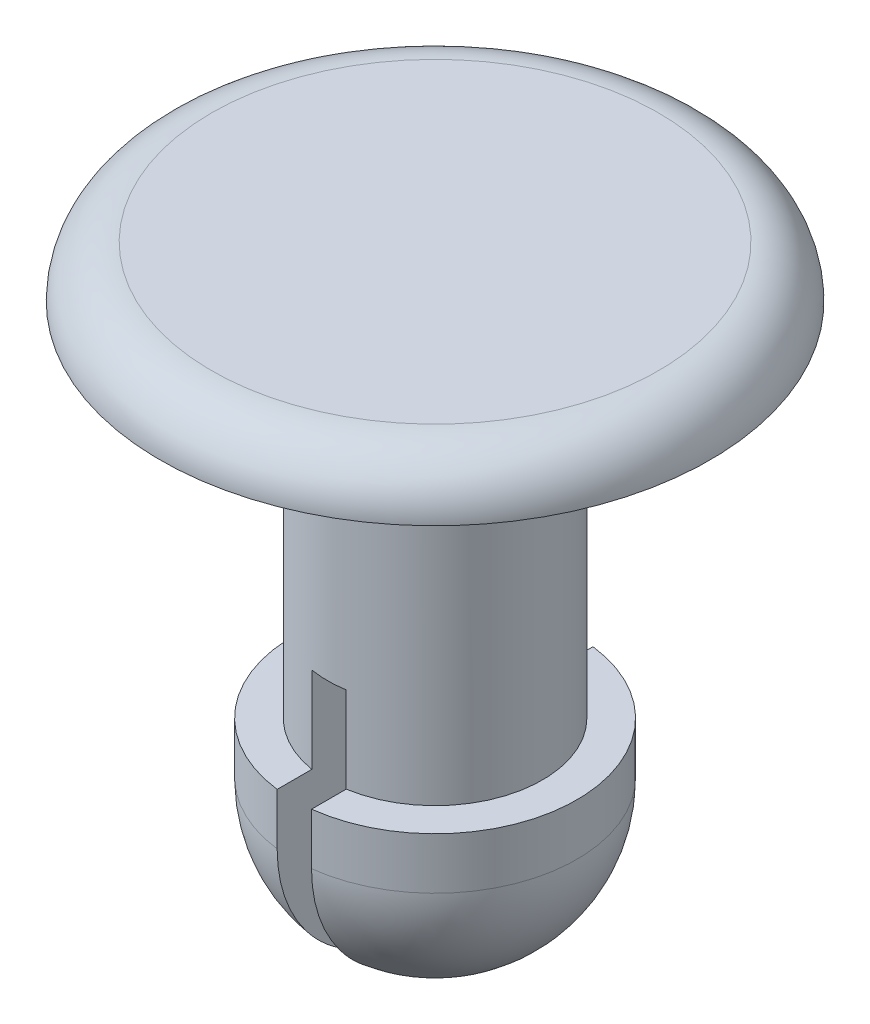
ISO-10303-21;
HEADER;
FILE_DESCRIPTION(('STEP AP214'),'2;1');
FILE_NAME('part.step','',(''),(''),'','','');
FILE_SCHEMA(('AUTOMOTIVE_DESIGN { 1 0 10303 214 1 1 1 1 }'));
ENDSEC;
DATA;
#1=APPLICATION_CONTEXT('core data for automotive mechanical design processes');
#2=APPLICATION_PROTOCOL_DEFINITION('international standard','automotive_design',2000,#1);
#3=PRODUCT_CONTEXT('',#1,'mechanical');
#4=PRODUCT('Part','Part','',(#3));
#5=PRODUCT_RELATED_PRODUCT_CATEGORY('part','',(#4));
#6=PRODUCT_DEFINITION_FORMATION('','',#4);
#7=PRODUCT_DEFINITION_CONTEXT('part definition',#1,'design');
#8=PRODUCT_DEFINITION('design','',#6,#7);
#9=PRODUCT_DEFINITION_SHAPE('','',#8);
#10=(LENGTH_UNIT() NAMED_UNIT(*) SI_UNIT(.MILLI.,.METRE.));
#11=(NAMED_UNIT(*) PLANE_ANGLE_UNIT() SI_UNIT($,.RADIAN.));
#12=(NAMED_UNIT(*) SI_UNIT($,.STERADIAN.) SOLID_ANGLE_UNIT());
#13=UNCERTAINTY_MEASURE_WITH_UNIT(LENGTH_MEASURE(1.E-05),#10,'distance_accuracy_value','');
#14=(GEOMETRIC_REPRESENTATION_CONTEXT(3) GLOBAL_UNCERTAINTY_ASSIGNED_CONTEXT((#13)) GLOBAL_UNIT_ASSIGNED_CONTEXT((#10,
#11,#12)) REPRESENTATION_CONTEXT('',''));
#15=CARTESIAN_POINT('',(0.,0.,0.));
#16=DIRECTION('',(0.,0.,1.));
#17=DIRECTION('',(1.,0.,0.));
#18=AXIS2_PLACEMENT_3D('',#15,#16,#17);
#19=CARTESIAN_POINT('',(1.5875,-5.334,0.));
#20=DIRECTION('',(0.,1.,0.));
#21=DIRECTION('',(-1.,0.,0.));
#22=AXIS2_PLACEMENT_3D('',#19,#20,#21);
#23=PLANE('',#22);
#24=DIRECTION('',(0.,0.,1.));
#25=VECTOR('',#24,1.);
#26=CARTESIAN_POINT('',(-0.253999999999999,-5.334,0.));
#27=LINE('',#26,#25);
#28=CARTESIAN_POINT('',(-0.253999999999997,-5.334,-2.08004909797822));
#29=VERTEX_POINT('',#28);
#30=CARTESIAN_POINT('',(-0.253999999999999,-5.334,-1.56704826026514));
#31=VERTEX_POINT('',#30);
#32=EDGE_CURVE('E51',#29,#31,#27,.T.);
#33=ORIENTED_EDGE('',*,*,#32,.F.);
#34=CARTESIAN_POINT('',(0.,-5.334,0.));
#35=DIRECTION('',(0.,1.,0.));
#36=DIRECTION('',(-1.,0.,0.));
#37=AXIS2_PLACEMENT_3D('',#34,#35,#36);
#38=CIRCLE('',#37,2.0955);
#39=CARTESIAN_POINT('',(-0.253999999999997,-5.334,2.08004909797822));
#40=VERTEX_POINT('',#39);
#41=EDGE_CURVE('E131',#29,#40,#38,.T.);
#42=ORIENTED_EDGE('',*,*,#41,.T.);
#43=CARTESIAN_POINT('',(-0.253999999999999,-5.334,1.56704826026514));
#44=VERTEX_POINT('',#43);
#45=EDGE_CURVE('E121',#44,#40,#27,.T.);
#46=ORIENTED_EDGE('',*,*,#45,.F.);
#47=CARTESIAN_POINT('',(0.,-5.334,0.));
#48=DIRECTION('',(0.,1.,0.));
#49=DIRECTION('',(-1.,0.,0.));
#50=AXIS2_PLACEMENT_3D('',#47,#48,#49);
#51=CIRCLE('',#50,1.5875);
#52=EDGE_CURVE('E135',#31,#44,#51,.T.);
#53=ORIENTED_EDGE('',*,*,#52,.F.);
#54=EDGE_LOOP('',(#33,#42,#46,#53));
#55=FACE_BOUND('',#54,.T.);
#56=ADVANCED_FACE('F28',(#55),#23,.T.);
#57=CARTESIAN_POINT('',(0.,0.,0.));
#58=DIRECTION('',(0.,1.,0.));
#59=DIRECTION('',(-1.,0.,0.));
#60=AXIS2_PLACEMENT_3D('',#57,#58,#59);
#61=CYLINDRICAL_SURFACE('',#60,2.0955);
#62=DIRECTION('',(0.,1.,0.));
#63=VECTOR('',#62,1.);
#64=CARTESIAN_POINT('',(-0.253999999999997,0.,2.08004909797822));
#65=LINE('',#64,#63);
#66=CARTESIAN_POINT('',(-0.253999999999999,-6.096,2.08004909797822));
#67=VERTEX_POINT('',#66);
#68=EDGE_CURVE('E114',#40,#67,#65,.F.);
#69=ORIENTED_EDGE('',*,*,#68,.F.);
#70=ORIENTED_EDGE('',*,*,#41,.F.);
#71=DIRECTION('',(0.,1.,0.));
#72=VECTOR('',#71,1.);
#73=CARTESIAN_POINT('',(-0.253999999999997,0.,-2.08004909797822));
#74=LINE('',#73,#72);
#75=CARTESIAN_POINT('',(-0.253999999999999,-6.096,-2.08004909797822));
#76=VERTEX_POINT('',#75);
#77=EDGE_CURVE('E112',#76,#29,#74,.T.);
#78=ORIENTED_EDGE('',*,*,#77,.F.);
#79=CARTESIAN_POINT('',(0.,-6.096,0.));
#80=DIRECTION('',(0.,1.,0.));
#81=DIRECTION('',(-1.,0.,0.));
#82=AXIS2_PLACEMENT_3D('',#79,#80,#81);
#83=CIRCLE('',#82,2.0955);
#84=EDGE_CURVE('E127',#76,#67,#83,.T.);
#85=ORIENTED_EDGE('',*,*,#84,.T.);
#86=EDGE_LOOP('',(#69,#70,#78,#85));
#87=FACE_BOUND('',#86,.T.);
#88=ADVANCED_FACE('F183',(#87),#61,.T.);
#89=CARTESIAN_POINT('',(0.,-6.096,0.));
#90=DIRECTION('',(0.,1.,0.));
#91=DIRECTION('',(1.,0.,0.));
#92=AXIS2_PLACEMENT_3D('',#89,#90,#91);
#93=SPHERICAL_SURFACE('',#92,2.0955);
#94=CARTESIAN_POINT('',(-0.253999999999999,-6.096,0.));
#95=DIRECTION('',(-1.,0.,0.));
#96=DIRECTION('',(0.,-1.,0.));
#97=AXIS2_PLACEMENT_3D('',#94,#95,#96);
#98=CIRCLE('',#97,2.08004909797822);
#99=EDGE_CURVE('E148',#67,#76,#98,.F.);
#100=ORIENTED_EDGE('',*,*,#99,.F.);
#101=ORIENTED_EDGE('',*,*,#84,.F.);
#102=EDGE_LOOP('',(#100,#101));
#103=FACE_BOUND('',#102,.T.);
#104=ADVANCED_FACE('F174',(#103),#93,.T.);
#105=CARTESIAN_POINT('',(0.,0.762,0.));
#106=DIRECTION('',(0.,1.,0.));
#107=DIRECTION('',(-1.,0.,0.));
#108=AXIS2_PLACEMENT_3D('',#105,#106,#107);
#109=PLANE('',#108);
#110=CARTESIAN_POINT('',(0.,0.762,0.));
#111=DIRECTION('',(0.,1.,0.));
#112=DIRECTION('',(-1.,0.,0.));
#113=AXIS2_PLACEMENT_3D('',#110,#111,#112);
#114=CIRCLE('',#113,3.302);
#115=CARTESIAN_POINT('',(-3.302,0.762,0.));
#116=VERTEX_POINT('',#115);
#117=EDGE_CURVE('E144',#116,#116,#114,.T.);
#118=ORIENTED_EDGE('',*,*,#117,.T.);
#119=EDGE_LOOP('',(#118));
#120=FACE_BOUND('',#119,.T.);
#121=ADVANCED_FACE('F30',(#120),#109,.T.);
#122=CARTESIAN_POINT('',(4.064,0.,0.));
#123=DIRECTION('',(0.,-1.,0.));
#124=DIRECTION('',(1.,0.,0.));
#125=AXIS2_PLACEMENT_3D('',#122,#123,#124);
#126=PLANE('',#125);
#127=CARTESIAN_POINT('',(0.,0.,0.));
#128=DIRECTION('',(0.,1.,0.));
#129=DIRECTION('',(-1.,0.,0.));
#130=AXIS2_PLACEMENT_3D('',#127,#128,#129);
#131=CIRCLE('',#130,1.58749999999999);
#132=CARTESIAN_POINT('',(-1.58749999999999,0.,0.));
#133=VERTEX_POINT('',#132);
#134=EDGE_CURVE('E138',#133,#133,#131,.T.);
#135=ORIENTED_EDGE('',*,*,#134,.T.);
#136=EDGE_LOOP('',(#135));
#137=FACE_BOUND('',#136,.T.);
#138=CARTESIAN_POINT('',(0.,0.,0.));
#139=DIRECTION('',(0.,1.,0.));
#140=DIRECTION('',(-1.,0.,0.));
#141=AXIS2_PLACEMENT_3D('',#138,#139,#140);
#142=CIRCLE('',#141,4.064);
#143=CARTESIAN_POINT('',(-4.064,0.,0.));
#144=VERTEX_POINT('',#143);
#145=EDGE_CURVE('E141',#144,#144,#142,.T.);
#146=ORIENTED_EDGE('',*,*,#145,.F.);
#147=EDGE_LOOP('',(#146));
#148=FACE_BOUND('',#147,.T.);
#149=ADVANCED_FACE('F198',(#137,#148),#126,.T.);
#150=CARTESIAN_POINT('',(0.,0.,0.));
#151=DIRECTION('',(0.,1.,0.));
#152=DIRECTION('',(-1.,0.,0.));
#153=AXIS2_PLACEMENT_3D('',#150,#151,#152);
#154=CYLINDRICAL_SURFACE('',#153,1.5875);
#155=DIRECTION('',(0.,1.,0.));
#156=VECTOR('',#155,1.);
#157=CARTESIAN_POINT('',(-0.253999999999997,0.,-1.56704826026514));
#158=LINE('',#157,#156);
#159=CARTESIAN_POINT('',(-0.253999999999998,-4.064,-1.56704826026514));
#160=VERTEX_POINT('',#159);
#161=EDGE_CURVE('E123',#31,#160,#158,.T.);
#162=ORIENTED_EDGE('',*,*,#161,.F.);
#163=ORIENTED_EDGE('',*,*,#52,.T.);
#164=DIRECTION('',(0.,1.,0.));
#165=VECTOR('',#164,1.);
#166=CARTESIAN_POINT('',(-0.253999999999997,0.,1.56704826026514));
#167=LINE('',#166,#165);
#168=CARTESIAN_POINT('',(-0.253999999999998,-4.064,1.56704826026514));
#169=VERTEX_POINT('',#168);
#170=EDGE_CURVE('E125',#169,#44,#167,.F.);
#171=ORIENTED_EDGE('',*,*,#170,.F.);
#172=CARTESIAN_POINT('',(0.,-4.064,0.));
#173=DIRECTION('',(0.,-1.,0.));
#174=DIRECTION('',(0.,0.,-1.));
#175=AXIS2_PLACEMENT_3D('',#172,#173,#174);
#176=CIRCLE('',#175,1.5875);
#177=CARTESIAN_POINT('',(0.254,-4.064,1.56704826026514));
#178=VERTEX_POINT('',#177);
#179=EDGE_CURVE('E32',#169,#178,#176,.F.);
#180=ORIENTED_EDGE('',*,*,#179,.T.);
#181=DIRECTION('',(0.,1.,0.));
#182=VECTOR('',#181,1.);
#183=CARTESIAN_POINT('',(0.254,0.,1.56704826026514));
#184=LINE('',#183,#182);
#185=CARTESIAN_POINT('',(0.254,-5.334,1.56704826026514));
#186=VERTEX_POINT('',#185);
#187=EDGE_CURVE('E105',#186,#178,#184,.T.);
#188=ORIENTED_EDGE('',*,*,#187,.F.);
#189=CARTESIAN_POINT('',(0.254,-5.334,-1.56704826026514));
#190=VERTEX_POINT('',#189);
#191=EDGE_CURVE('E111',#186,#190,#51,.T.);
#192=ORIENTED_EDGE('',*,*,#191,.T.);
#193=DIRECTION('',(0.,1.,0.));
#194=VECTOR('',#193,1.);
#195=CARTESIAN_POINT('',(0.254,0.,-1.56704826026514));
#196=LINE('',#195,#194);
#197=CARTESIAN_POINT('',(0.254,-4.064,-1.56704826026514));
#198=VERTEX_POINT('',#197);
#199=EDGE_CURVE('E102',#198,#190,#196,.F.);
#200=ORIENTED_EDGE('',*,*,#199,.F.);
#201=EDGE_CURVE('E11',#198,#160,#176,.F.);
#202=ORIENTED_EDGE('',*,*,#201,.T.);
#203=EDGE_LOOP('',(#162,#163,#171,#180,#188,#192,#200,#202));
#204=FACE_BOUND('',#203,.T.);
#205=ORIENTED_EDGE('',*,*,#134,.F.);
#206=EDGE_LOOP('',(#205));
#207=FACE_BOUND('',#206,.T.);
#208=ADVANCED_FACE('F108',(#204,#207),#154,.T.);
#209=DIRECTION('',(0.,0.,-1.));
#210=VECTOR('',#209,1.);
#211=CARTESIAN_POINT('',(0.254,-5.334,0.));
#212=LINE('',#211,#210);
#213=CARTESIAN_POINT('',(0.253999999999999,-5.334,2.08004909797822));
#214=VERTEX_POINT('',#213);
#215=EDGE_CURVE('E116',#214,#186,#212,.T.);
#216=ORIENTED_EDGE('',*,*,#215,.F.);
#217=CARTESIAN_POINT('',(0.253999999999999,-5.334,-2.08004909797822));
#218=VERTEX_POINT('',#217);
#219=EDGE_CURVE('E134',#214,#218,#38,.T.);
#220=ORIENTED_EDGE('',*,*,#219,.T.);
#221=EDGE_CURVE('E158',#190,#218,#212,.T.);
#222=ORIENTED_EDGE('',*,*,#221,.F.);
#223=ORIENTED_EDGE('',*,*,#191,.F.);
#224=EDGE_LOOP('',(#216,#220,#222,#223));
#225=FACE_BOUND('',#224,.T.);
#226=ADVANCED_FACE('F164',(#225),#23,.T.);
#227=DIRECTION('',(0.,1.,0.));
#228=VECTOR('',#227,1.);
#229=CARTESIAN_POINT('',(0.254,0.,-2.08004909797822));
#230=LINE('',#229,#228);
#231=CARTESIAN_POINT('',(0.254,-6.096,-2.08004909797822));
#232=VERTEX_POINT('',#231);
#233=EDGE_CURVE('E43',#218,#232,#230,.F.);
#234=ORIENTED_EDGE('',*,*,#233,.F.);
#235=ORIENTED_EDGE('',*,*,#219,.F.);
#236=DIRECTION('',(0.,1.,0.));
#237=VECTOR('',#236,1.);
#238=CARTESIAN_POINT('',(0.254,0.,2.08004909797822));
#239=LINE('',#238,#237);
#240=CARTESIAN_POINT('',(0.254,-6.096,2.08004909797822));
#241=VERTEX_POINT('',#240);
#242=EDGE_CURVE('E154',#241,#214,#239,.T.);
#243=ORIENTED_EDGE('',*,*,#242,.F.);
#244=EDGE_CURVE('E130',#241,#232,#83,.T.);
#245=ORIENTED_EDGE('',*,*,#244,.T.);
#246=EDGE_LOOP('',(#234,#235,#243,#245));
#247=FACE_BOUND('',#246,.T.);
#248=ADVANCED_FACE('F166',(#247),#61,.T.);
#249=CARTESIAN_POINT('',(0.254,-6.096,0.));
#250=DIRECTION('',(1.,0.,0.));
#251=DIRECTION('',(0.,0.,-1.));
#252=AXIS2_PLACEMENT_3D('',#249,#250,#251);
#253=CIRCLE('',#252,2.08004909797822);
#254=EDGE_CURVE('E147',#232,#241,#253,.F.);
#255=ORIENTED_EDGE('',*,*,#254,.F.);
#256=ORIENTED_EDGE('',*,*,#244,.F.);
#257=EDGE_LOOP('',(#255,#256));
#258=FACE_BOUND('',#257,.T.);
#259=ADVANCED_FACE('F170',(#258),#93,.T.);
#260=CARTESIAN_POINT('',(0.,0.,0.));
#261=DIRECTION('',(0.,1.,0.));
#262=DIRECTION('',(-1.,0.,0.));
#263=AXIS2_PLACEMENT_3D('',#260,#261,#262);
#264=TOROIDAL_SURFACE('',#263,3.302,0.762);
#265=ORIENTED_EDGE('',*,*,#145,.T.);
#266=EDGE_LOOP('',(#265));
#267=FACE_BOUND('',#266,.T.);
#268=ORIENTED_EDGE('',*,*,#117,.F.);
#269=EDGE_LOOP('',(#268));
#270=FACE_BOUND('',#269,.T.);
#271=ADVANCED_FACE('F172',(#267,#270),#264,.T.);
#272=CARTESIAN_POINT('',(-0.253999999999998,-4.064,-4.064));
#273=DIRECTION('',(-1.,0.,0.));
#274=DIRECTION('',(0.,-1.,0.));
#275=AXIS2_PLACEMENT_3D('',#272,#273,#274);
#276=PLANE('',#275);
#277=ORIENTED_EDGE('',*,*,#170,.T.);
#278=ORIENTED_EDGE('',*,*,#45,.T.);
#279=ORIENTED_EDGE('',*,*,#68,.T.);
#280=ORIENTED_EDGE('',*,*,#99,.T.);
#281=ORIENTED_EDGE('',*,*,#77,.T.);
#282=ORIENTED_EDGE('',*,*,#32,.T.);
#283=ORIENTED_EDGE('',*,*,#161,.T.);
#284=DIRECTION('',(0.,0.,1.));
#285=VECTOR('',#284,1.);
#286=CARTESIAN_POINT('',(-0.253999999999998,-4.064,-4.064));
#287=LINE('',#286,#285);
#288=EDGE_CURVE('E98',#160,#169,#287,.T.);
#289=ORIENTED_EDGE('',*,*,#288,.T.);
#290=EDGE_LOOP('',(#277,#278,#279,#280,#281,#282,#283,#289));
#291=FACE_BOUND('',#290,.T.);
#292=ADVANCED_FACE('F152',(#291),#276,.F.);
#293=CARTESIAN_POINT('',(-0.253999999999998,-4.064,-4.064));
#294=DIRECTION('',(0.,-1.,0.));
#295=DIRECTION('',(0.,0.,-1.));
#296=AXIS2_PLACEMENT_3D('',#293,#294,#295);
#297=PLANE('',#296);
#298=ORIENTED_EDGE('',*,*,#288,.F.);
#299=ORIENTED_EDGE('',*,*,#201,.F.);
#300=DIRECTION('',(0.,0.,1.));
#301=VECTOR('',#300,1.);
#302=CARTESIAN_POINT('',(0.254,-4.064,-4.064));
#303=LINE('',#302,#301);
#304=EDGE_CURVE('E95',#198,#178,#303,.T.);
#305=ORIENTED_EDGE('',*,*,#304,.T.);
#306=ORIENTED_EDGE('',*,*,#179,.F.);
#307=EDGE_LOOP('',(#298,#299,#305,#306));
#308=FACE_BOUND('',#307,.T.);
#309=ADVANCED_FACE('F94',(#308),#297,.T.);
#310=CARTESIAN_POINT('',(0.254,-8.1915,-4.064));
#311=DIRECTION('',(1.,0.,0.));
#312=DIRECTION('',(0.,0.,-1.));
#313=AXIS2_PLACEMENT_3D('',#310,#311,#312);
#314=PLANE('',#313);
#315=ORIENTED_EDGE('',*,*,#199,.T.);
#316=ORIENTED_EDGE('',*,*,#221,.T.);
#317=ORIENTED_EDGE('',*,*,#233,.T.);
#318=ORIENTED_EDGE('',*,*,#254,.T.);
#319=ORIENTED_EDGE('',*,*,#242,.T.);
#320=ORIENTED_EDGE('',*,*,#215,.T.);
#321=ORIENTED_EDGE('',*,*,#187,.T.);
#322=ORIENTED_EDGE('',*,*,#304,.F.);
#323=EDGE_LOOP('',(#315,#316,#317,#318,#319,#320,#321,#322));
#324=FACE_BOUND('',#323,.T.);
#325=ADVANCED_FACE('F101',(#324),#314,.F.);
#326=CLOSED_SHELL('',(#56,#88,#104,#121,#149,#208,#226,#248,#259,#271,#292,#309,#325));
#327=MANIFOLD_SOLID_BREP('B2',#326);
#328=ADVANCED_BREP_SHAPE_REPRESENTATION('',(#18,#327),#14);
#329=SHAPE_DEFINITION_REPRESENTATION(#9,#328);
ENDSEC;
END-ISO-10303-21;
